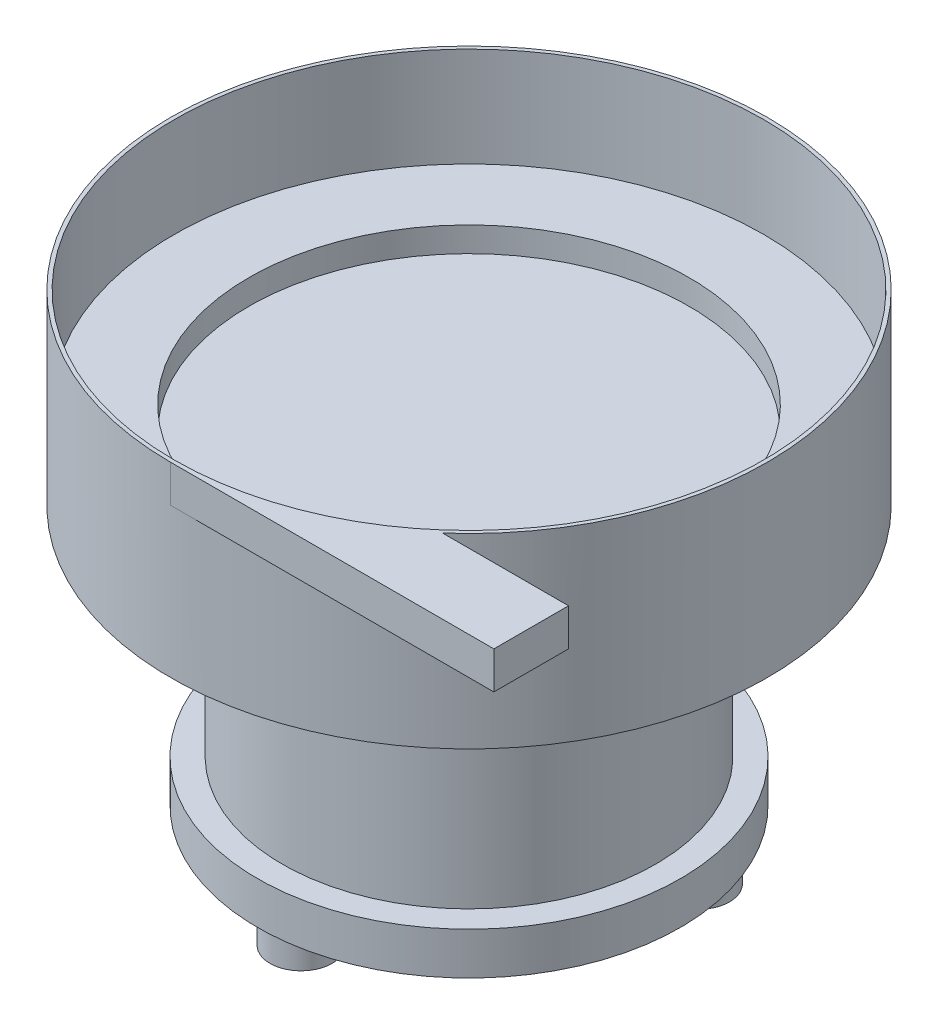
ISO-10303-21;
HEADER;
FILE_DESCRIPTION(('STEP AP214'),'2;1');
FILE_NAME('part.step','',(''),(''),'','','');
FILE_SCHEMA(('AUTOMOTIVE_DESIGN { 1 0 10303 214 1 1 1 1 }'));
ENDSEC;
DATA;
#1=APPLICATION_CONTEXT('core data for automotive mechanical design processes');
#2=APPLICATION_PROTOCOL_DEFINITION('international standard','automotive_design',2000,#1);
#3=PRODUCT_CONTEXT('',#1,'mechanical');
#4=PRODUCT('Part','Part','',(#3));
#5=PRODUCT_RELATED_PRODUCT_CATEGORY('part','',(#4));
#6=PRODUCT_DEFINITION_FORMATION('','',#4);
#7=PRODUCT_DEFINITION_CONTEXT('part definition',#1,'design');
#8=PRODUCT_DEFINITION('design','',#6,#7);
#9=PRODUCT_DEFINITION_SHAPE('','',#8);
#10=(LENGTH_UNIT() NAMED_UNIT(*) SI_UNIT(.MILLI.,.METRE.));
#11=(NAMED_UNIT(*) PLANE_ANGLE_UNIT() SI_UNIT($,.RADIAN.));
#12=(NAMED_UNIT(*) SI_UNIT($,.STERADIAN.) SOLID_ANGLE_UNIT());
#13=UNCERTAINTY_MEASURE_WITH_UNIT(LENGTH_MEASURE(1.E-05),#10,'distance_accuracy_value','');
#14=(GEOMETRIC_REPRESENTATION_CONTEXT(3) GLOBAL_UNCERTAINTY_ASSIGNED_CONTEXT((#13)) GLOBAL_UNIT_ASSIGNED_CONTEXT((#10,
#11,#12)) REPRESENTATION_CONTEXT('',''));
#15=CARTESIAN_POINT('',(0.,0.,0.));
#16=DIRECTION('',(0.,0.,1.));
#17=DIRECTION('',(1.,0.,0.));
#18=AXIS2_PLACEMENT_3D('',#15,#16,#17);
#19=CARTESIAN_POINT('',(0.,0.,0.));
#20=DIRECTION('',(0.,-1.,0.));
#21=DIRECTION('',(0.,0.,-1.));
#22=AXIS2_PLACEMENT_3D('',#19,#20,#21);
#23=CYLINDRICAL_SURFACE('',#22,240.);
#24=CARTESIAN_POINT('',(0.,209.,0.));
#25=DIRECTION('',(0.,-1.,0.));
#26=DIRECTION('',(0.,0.,-1.));
#27=AXIS2_PLACEMENT_3D('',#24,#25,#26);
#28=CIRCLE('',#27,240.);
#29=CARTESIAN_POINT('',(0.,209.,-240.));
#30=VERTEX_POINT('',#29);
#31=EDGE_CURVE('E116',#30,#30,#28,.T.);
#32=ORIENTED_EDGE('',*,*,#31,.F.);
#33=EDGE_LOOP('',(#32));
#34=FACE_BOUND('',#33,.T.);
#35=CARTESIAN_POINT('',(0.,359.,0.));
#36=DIRECTION('',(0.,-1.,0.));
#37=DIRECTION('',(0.,0.,-1.));
#38=AXIS2_PLACEMENT_3D('',#35,#36,#37);
#39=CIRCLE('',#38,240.);
#40=CARTESIAN_POINT('',(0.,359.,240.));
#41=VERTEX_POINT('',#40);
#42=CARTESIAN_POINT('',(158.745078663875,359.,180.));
#43=VERTEX_POINT('',#42);
#44=EDGE_CURVE('E111',#41,#43,#39,.T.);
#45=ORIENTED_EDGE('',*,*,#44,.T.);
#46=DIRECTION('',(0.,-1.,0.));
#47=VECTOR('',#46,1.);
#48=CARTESIAN_POINT('',(158.745078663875,0.,180.));
#49=LINE('',#48,#47);
#50=CARTESIAN_POINT('',(158.745078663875,329.,180.));
#51=VERTEX_POINT('',#50);
#52=EDGE_CURVE('E74',#43,#51,#49,.T.);
#53=ORIENTED_EDGE('',*,*,#52,.T.);
#54=CARTESIAN_POINT('',(0.,329.,0.));
#55=DIRECTION('',(0.,1.,0.));
#56=DIRECTION('',(0.,0.,1.));
#57=AXIS2_PLACEMENT_3D('',#54,#55,#56);
#58=CIRCLE('',#57,240.);
#59=CARTESIAN_POINT('',(0.,329.,240.));
#60=VERTEX_POINT('',#59);
#61=EDGE_CURVE('E39',#51,#60,#58,.F.);
#62=ORIENTED_EDGE('',*,*,#61,.T.);
#63=DIRECTION('',(0.,-1.,0.));
#64=VECTOR('',#63,1.);
#65=CARTESIAN_POINT('',(0.,359.,240.));
#66=LINE('',#65,#64);
#67=EDGE_CURVE('E71',#41,#60,#66,.T.);
#68=ORIENTED_EDGE('',*,*,#67,.F.);
#69=EDGE_LOOP('',(#45,#53,#62,#68));
#70=FACE_BOUND('',#69,.T.);
#71=ADVANCED_FACE('F16',(#34,#70),#23,.T.);
#72=CARTESIAN_POINT('',(0.,279.,0.));
#73=DIRECTION('',(0.,1.,0.));
#74=DIRECTION('',(0.,0.,1.));
#75=AXIS2_PLACEMENT_3D('',#72,#73,#74);
#76=CYLINDRICAL_SURFACE('',#75,237.);
#77=CARTESIAN_POINT('',(0.,359.,0.));
#78=DIRECTION('',(0.,1.,0.));
#79=DIRECTION('',(0.,0.,1.));
#80=AXIS2_PLACEMENT_3D('',#77,#78,#79);
#81=CIRCLE('',#80,237.);
#82=CARTESIAN_POINT('',(0.,359.,237.));
#83=VERTEX_POINT('',#82);
#84=EDGE_CURVE('E87',#83,#83,#81,.T.);
#85=ORIENTED_EDGE('',*,*,#84,.T.);
#86=EDGE_LOOP('',(#85));
#87=FACE_BOUND('',#86,.T.);
#88=CARTESIAN_POINT('',(0.,279.,0.));
#89=DIRECTION('',(0.,1.,0.));
#90=DIRECTION('',(0.,0.,1.));
#91=AXIS2_PLACEMENT_3D('',#88,#89,#90);
#92=CIRCLE('',#91,237.);
#93=CARTESIAN_POINT('',(0.,279.,237.));
#94=VERTEX_POINT('',#93);
#95=EDGE_CURVE('E90',#94,#94,#92,.T.);
#96=ORIENTED_EDGE('',*,*,#95,.F.);
#97=EDGE_LOOP('',(#96));
#98=FACE_BOUND('',#97,.T.);
#99=ADVANCED_FACE('F145',(#87,#98),#76,.F.);
#100=CARTESIAN_POINT('',(0.,0.,0.));
#101=DIRECTION('',(0.,-1.,0.));
#102=DIRECTION('',(0.,0.,-1.));
#103=AXIS2_PLACEMENT_3D('',#100,#101,#102);
#104=PLANE('',#103);
#105=CARTESIAN_POINT('',(-116.913429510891,0.,-67.500000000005));
#106=DIRECTION('',(0.,-1.,0.));
#107=DIRECTION('',(0.,0.,-1.));
#108=AXIS2_PLACEMENT_3D('',#105,#106,#107);
#109=CIRCLE('',#108,25.);
#110=CARTESIAN_POINT('',(-116.913429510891,0.,-92.500000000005));
#111=VERTEX_POINT('',#110);
#112=EDGE_CURVE('E93',#111,#111,#109,.T.);
#113=ORIENTED_EDGE('',*,*,#112,.F.);
#114=EDGE_LOOP('',(#113));
#115=FACE_BOUND('',#114,.T.);
#116=CARTESIAN_POINT('',(116.913429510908,0.,-67.499999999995));
#117=DIRECTION('',(0.,-1.,0.));
#118=DIRECTION('',(0.,0.,-1.));
#119=AXIS2_PLACEMENT_3D('',#116,#117,#118);
#120=CIRCLE('',#119,25.);
#121=CARTESIAN_POINT('',(116.913429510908,0.,-92.499999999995));
#122=VERTEX_POINT('',#121);
#123=EDGE_CURVE('E99',#122,#122,#120,.T.);
#124=ORIENTED_EDGE('',*,*,#123,.F.);
#125=EDGE_LOOP('',(#124));
#126=FACE_BOUND('',#125,.T.);
#127=CARTESIAN_POINT('',(0.,0.,135.));
#128=DIRECTION('',(0.,-1.,0.));
#129=DIRECTION('',(0.,0.,-1.));
#130=AXIS2_PLACEMENT_3D('',#127,#128,#129);
#131=CIRCLE('',#130,25.);
#132=CARTESIAN_POINT('',(0.,0.,110.));
#133=VERTEX_POINT('',#132);
#134=EDGE_CURVE('E105',#133,#133,#131,.T.);
#135=ORIENTED_EDGE('',*,*,#134,.F.);
#136=EDGE_LOOP('',(#135));
#137=FACE_BOUND('',#136,.T.);
#138=CARTESIAN_POINT('',(0.,0.,0.));
#139=DIRECTION('',(0.,-1.,0.));
#140=DIRECTION('',(0.,0.,-1.));
#141=AXIS2_PLACEMENT_3D('',#138,#139,#140);
#142=CIRCLE('',#141,170.);
#143=CARTESIAN_POINT('',(0.,0.,-170.));
#144=VERTEX_POINT('',#143);
#145=EDGE_CURVE('E11',#144,#144,#142,.T.);
#146=ORIENTED_EDGE('',*,*,#145,.T.);
#147=EDGE_LOOP('',(#146));
#148=FACE_BOUND('',#147,.T.);
#149=ADVANCED_FACE('F18',(#115,#126,#137,#148),#104,.T.);
#150=CARTESIAN_POINT('',(0.,0.,0.));
#151=DIRECTION('',(0.,-1.,0.));
#152=DIRECTION('',(0.,0.,-1.));
#153=AXIS2_PLACEMENT_3D('',#150,#151,#152);
#154=CYLINDRICAL_SURFACE('',#153,170.);
#155=CARTESIAN_POINT('',(0.,34.,0.));
#156=DIRECTION('',(0.,-1.,0.));
#157=DIRECTION('',(0.,0.,-1.));
#158=AXIS2_PLACEMENT_3D('',#155,#156,#157);
#159=CIRCLE('',#158,170.);
#160=CARTESIAN_POINT('',(0.,34.,-170.));
#161=VERTEX_POINT('',#160);
#162=EDGE_CURVE('E24',#161,#161,#159,.T.);
#163=ORIENTED_EDGE('',*,*,#162,.T.);
#164=EDGE_LOOP('',(#163));
#165=FACE_BOUND('',#164,.T.);
#166=ORIENTED_EDGE('',*,*,#145,.F.);
#167=EDGE_LOOP('',(#166));
#168=FACE_BOUND('',#167,.T.);
#169=ADVANCED_FACE('F127',(#165,#168),#154,.T.);
#170=CARTESIAN_POINT('',(170.,34.,0.));
#171=DIRECTION('',(0.,1.,0.));
#172=DIRECTION('',(0.,0.,1.));
#173=AXIS2_PLACEMENT_3D('',#170,#171,#172);
#174=PLANE('',#173);
#175=CARTESIAN_POINT('',(0.,34.,0.));
#176=DIRECTION('',(0.,-1.,0.));
#177=DIRECTION('',(0.,0.,-1.));
#178=AXIS2_PLACEMENT_3D('',#175,#176,#177);
#179=CIRCLE('',#178,150.);
#180=CARTESIAN_POINT('',(0.,34.,-150.));
#181=VERTEX_POINT('',#180);
#182=EDGE_CURVE('E122',#181,#181,#179,.T.);
#183=ORIENTED_EDGE('',*,*,#182,.T.);
#184=EDGE_LOOP('',(#183));
#185=FACE_BOUND('',#184,.T.);
#186=ORIENTED_EDGE('',*,*,#162,.F.);
#187=EDGE_LOOP('',(#186));
#188=FACE_BOUND('',#187,.T.);
#189=ADVANCED_FACE('F130',(#185,#188),#174,.T.);
#190=CARTESIAN_POINT('',(0.,0.,0.));
#191=DIRECTION('',(0.,-1.,0.));
#192=DIRECTION('',(0.,0.,-1.));
#193=AXIS2_PLACEMENT_3D('',#190,#191,#192);
#194=CYLINDRICAL_SURFACE('',#193,150.);
#195=CARTESIAN_POINT('',(0.,209.,0.));
#196=DIRECTION('',(0.,-1.,0.));
#197=DIRECTION('',(0.,0.,-1.));
#198=AXIS2_PLACEMENT_3D('',#195,#196,#197);
#199=CIRCLE('',#198,150.);
#200=CARTESIAN_POINT('',(0.,209.,-150.));
#201=VERTEX_POINT('',#200);
#202=EDGE_CURVE('E119',#201,#201,#199,.T.);
#203=ORIENTED_EDGE('',*,*,#202,.T.);
#204=EDGE_LOOP('',(#203));
#205=FACE_BOUND('',#204,.T.);
#206=ORIENTED_EDGE('',*,*,#182,.F.);
#207=EDGE_LOOP('',(#206));
#208=FACE_BOUND('',#207,.T.);
#209=ADVANCED_FACE('F132',(#205,#208),#194,.T.);
#210=CARTESIAN_POINT('',(150.,209.,0.));
#211=DIRECTION('',(0.,-1.,0.));
#212=DIRECTION('',(0.,0.,-1.));
#213=AXIS2_PLACEMENT_3D('',#210,#211,#212);
#214=PLANE('',#213);
#215=ORIENTED_EDGE('',*,*,#31,.T.);
#216=EDGE_LOOP('',(#215));
#217=FACE_BOUND('',#216,.T.);
#218=ORIENTED_EDGE('',*,*,#202,.F.);
#219=EDGE_LOOP('',(#218));
#220=FACE_BOUND('',#219,.T.);
#221=ADVANCED_FACE('F141',(#217,#220),#214,.T.);
#222=CARTESIAN_POINT('',(240.,359.,0.));
#223=DIRECTION('',(0.,1.,0.));
#224=DIRECTION('',(0.,0.,1.));
#225=AXIS2_PLACEMENT_3D('',#222,#223,#224);
#226=PLANE('',#225);
#227=ORIENTED_EDGE('',*,*,#84,.F.);
#228=EDGE_LOOP('',(#227));
#229=FACE_BOUND('',#228,.T.);
#230=ORIENTED_EDGE('',*,*,#44,.F.);
#231=DIRECTION('',(-1.,0.,0.));
#232=VECTOR('',#231,1.);
#233=CARTESIAN_POINT('',(260.,359.,240.));
#234=LINE('',#233,#232);
#235=CARTESIAN_POINT('',(260.,359.,240.));
#236=VERTEX_POINT('',#235);
#237=EDGE_CURVE('E31',#236,#41,#234,.T.);
#238=ORIENTED_EDGE('',*,*,#237,.F.);
#239=DIRECTION('',(0.,0.,1.));
#240=VECTOR('',#239,1.);
#241=CARTESIAN_POINT('',(260.,359.,240.));
#242=LINE('',#241,#240);
#243=CARTESIAN_POINT('',(260.,359.,180.));
#244=VERTEX_POINT('',#243);
#245=EDGE_CURVE('E70',#244,#236,#242,.T.);
#246=ORIENTED_EDGE('',*,*,#245,.F.);
#247=DIRECTION('',(-1.,0.,0.));
#248=VECTOR('',#247,1.);
#249=CARTESIAN_POINT('',(260.,359.,180.));
#250=LINE('',#249,#248);
#251=EDGE_CURVE('E78',#244,#43,#250,.T.);
#252=ORIENTED_EDGE('',*,*,#251,.T.);
#253=EDGE_LOOP('',(#230,#238,#246,#252));
#254=FACE_BOUND('',#253,.T.);
#255=ADVANCED_FACE('F158',(#229,#254),#226,.T.);
#256=CARTESIAN_POINT('',(0.,-30.,135.));
#257=DIRECTION('',(0.,1.,0.));
#258=DIRECTION('',(0.,0.,1.));
#259=AXIS2_PLACEMENT_3D('',#256,#257,#258);
#260=CYLINDRICAL_SURFACE('',#259,25.);
#261=CARTESIAN_POINT('',(0.,-30.,135.));
#262=DIRECTION('',(0.,-1.,0.));
#263=DIRECTION('',(0.,0.,-1.));
#264=AXIS2_PLACEMENT_3D('',#261,#262,#263);
#265=CIRCLE('',#264,25.);
#266=CARTESIAN_POINT('',(0.,-30.,110.));
#267=VERTEX_POINT('',#266);
#268=EDGE_CURVE('E108',#267,#267,#265,.T.);
#269=ORIENTED_EDGE('',*,*,#268,.F.);
#270=EDGE_LOOP('',(#269));
#271=FACE_BOUND('',#270,.T.);
#272=ORIENTED_EDGE('',*,*,#134,.T.);
#273=EDGE_LOOP('',(#272));
#274=FACE_BOUND('',#273,.T.);
#275=ADVANCED_FACE('F166',(#271,#274),#260,.T.);
#276=CARTESIAN_POINT('',(0.,-30.,135.));
#277=DIRECTION('',(0.,-1.,0.));
#278=DIRECTION('',(0.,0.,-1.));
#279=AXIS2_PLACEMENT_3D('',#276,#277,#278);
#280=PLANE('',#279);
#281=ORIENTED_EDGE('',*,*,#268,.T.);
#282=EDGE_LOOP('',(#281));
#283=FACE_BOUND('',#282,.T.);
#284=ADVANCED_FACE('F176',(#283),#280,.T.);
#285=CARTESIAN_POINT('',(116.913429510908,-30.,-67.499999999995));
#286=DIRECTION('',(0.,1.,0.));
#287=DIRECTION('',(0.,0.,1.));
#288=AXIS2_PLACEMENT_3D('',#285,#286,#287);
#289=CYLINDRICAL_SURFACE('',#288,25.);
#290=CARTESIAN_POINT('',(116.913429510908,-30.,-67.499999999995));
#291=DIRECTION('',(0.,-1.,0.));
#292=DIRECTION('',(0.,0.,-1.));
#293=AXIS2_PLACEMENT_3D('',#290,#291,#292);
#294=CIRCLE('',#293,25.);
#295=CARTESIAN_POINT('',(116.913429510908,-30.,-92.499999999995));
#296=VERTEX_POINT('',#295);
#297=EDGE_CURVE('E102',#296,#296,#294,.T.);
#298=ORIENTED_EDGE('',*,*,#297,.F.);
#299=EDGE_LOOP('',(#298));
#300=FACE_BOUND('',#299,.T.);
#301=ORIENTED_EDGE('',*,*,#123,.T.);
#302=EDGE_LOOP('',(#301));
#303=FACE_BOUND('',#302,.T.);
#304=ADVANCED_FACE('F224',(#300,#303),#289,.T.);
#305=CARTESIAN_POINT('',(116.913429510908,-30.,-67.499999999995));
#306=DIRECTION('',(0.,-1.,0.));
#307=DIRECTION('',(0.,0.,-1.));
#308=AXIS2_PLACEMENT_3D('',#305,#306,#307);
#309=PLANE('',#308);
#310=ORIENTED_EDGE('',*,*,#297,.T.);
#311=EDGE_LOOP('',(#310));
#312=FACE_BOUND('',#311,.T.);
#313=ADVANCED_FACE('F220',(#312),#309,.T.);
#314=CARTESIAN_POINT('',(-116.913429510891,-30.,-67.500000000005));
#315=DIRECTION('',(0.,1.,0.));
#316=DIRECTION('',(0.,0.,1.));
#317=AXIS2_PLACEMENT_3D('',#314,#315,#316);
#318=CYLINDRICAL_SURFACE('',#317,25.);
#319=CARTESIAN_POINT('',(-116.913429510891,-30.,-67.500000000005));
#320=DIRECTION('',(0.,-1.,0.));
#321=DIRECTION('',(0.,0.,-1.));
#322=AXIS2_PLACEMENT_3D('',#319,#320,#321);
#323=CIRCLE('',#322,25.);
#324=CARTESIAN_POINT('',(-116.913429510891,-30.,-92.500000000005));
#325=VERTEX_POINT('',#324);
#326=EDGE_CURVE('E96',#325,#325,#323,.T.);
#327=ORIENTED_EDGE('',*,*,#326,.F.);
#328=EDGE_LOOP('',(#327));
#329=FACE_BOUND('',#328,.T.);
#330=ORIENTED_EDGE('',*,*,#112,.T.);
#331=EDGE_LOOP('',(#330));
#332=FACE_BOUND('',#331,.T.);
#333=ADVANCED_FACE('F216',(#329,#332),#318,.T.);
#334=CARTESIAN_POINT('',(-116.913429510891,-30.,-67.500000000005));
#335=DIRECTION('',(0.,-1.,0.));
#336=DIRECTION('',(0.,0.,-1.));
#337=AXIS2_PLACEMENT_3D('',#334,#335,#336);
#338=PLANE('',#337);
#339=ORIENTED_EDGE('',*,*,#326,.T.);
#340=EDGE_LOOP('',(#339));
#341=FACE_BOUND('',#340,.T.);
#342=ADVANCED_FACE('F211',(#341),#338,.T.);
#343=CARTESIAN_POINT('',(0.,279.,0.));
#344=DIRECTION('',(0.,1.,0.));
#345=DIRECTION('',(0.,0.,1.));
#346=AXIS2_PLACEMENT_3D('',#343,#344,#345);
#347=PLANE('',#346);
#348=CARTESIAN_POINT('',(0.,279.,0.));
#349=DIRECTION('',(0.,1.,0.));
#350=DIRECTION('',(0.,0.,1.));
#351=AXIS2_PLACEMENT_3D('',#348,#349,#350);
#352=CIRCLE('',#351,177.);
#353=CARTESIAN_POINT('',(0.,279.,177.));
#354=VERTEX_POINT('',#353);
#355=EDGE_CURVE('E83',#354,#354,#352,.T.);
#356=ORIENTED_EDGE('',*,*,#355,.F.);
#357=EDGE_LOOP('',(#356));
#358=FACE_BOUND('',#357,.T.);
#359=ORIENTED_EDGE('',*,*,#95,.T.);
#360=EDGE_LOOP('',(#359));
#361=FACE_BOUND('',#360,.T.);
#362=ADVANCED_FACE('F208',(#358,#361),#347,.T.);
#363=CARTESIAN_POINT('',(0.,259.,0.));
#364=DIRECTION('',(0.,1.,0.));
#365=DIRECTION('',(0.,0.,1.));
#366=AXIS2_PLACEMENT_3D('',#363,#364,#365);
#367=CYLINDRICAL_SURFACE('',#366,177.);
#368=CARTESIAN_POINT('',(0.,259.,0.));
#369=DIRECTION('',(0.,1.,0.));
#370=DIRECTION('',(0.,0.,1.));
#371=AXIS2_PLACEMENT_3D('',#368,#369,#370);
#372=CIRCLE('',#371,177.);
#373=CARTESIAN_POINT('',(0.,259.,177.));
#374=VERTEX_POINT('',#373);
#375=EDGE_CURVE('E84',#374,#374,#372,.T.);
#376=ORIENTED_EDGE('',*,*,#375,.F.);
#377=EDGE_LOOP('',(#376));
#378=FACE_BOUND('',#377,.T.);
#379=ORIENTED_EDGE('',*,*,#355,.T.);
#380=EDGE_LOOP('',(#379));
#381=FACE_BOUND('',#380,.T.);
#382=ADVANCED_FACE('F204',(#378,#381),#367,.F.);
#383=CARTESIAN_POINT('',(0.,259.,0.));
#384=DIRECTION('',(0.,1.,0.));
#385=DIRECTION('',(0.,0.,1.));
#386=AXIS2_PLACEMENT_3D('',#383,#384,#385);
#387=PLANE('',#386);
#388=ORIENTED_EDGE('',*,*,#375,.T.);
#389=EDGE_LOOP('',(#388));
#390=FACE_BOUND('',#389,.T.);
#391=ADVANCED_FACE('F201',(#390),#387,.T.);
#392=CARTESIAN_POINT('',(260.,359.,240.));
#393=DIRECTION('',(0.,0.,-1.));
#394=DIRECTION('',(-1.,0.,0.));
#395=AXIS2_PLACEMENT_3D('',#392,#393,#394);
#396=PLANE('',#395);
#397=ORIENTED_EDGE('',*,*,#67,.T.);
#398=DIRECTION('',(-1.,0.,0.));
#399=VECTOR('',#398,1.);
#400=CARTESIAN_POINT('',(260.,329.,240.));
#401=LINE('',#400,#399);
#402=CARTESIAN_POINT('',(260.,329.,240.));
#403=VERTEX_POINT('',#402);
#404=EDGE_CURVE('E61',#403,#60,#401,.T.);
#405=ORIENTED_EDGE('',*,*,#404,.F.);
#406=DIRECTION('',(0.,-1.,0.));
#407=VECTOR('',#406,1.);
#408=CARTESIAN_POINT('',(260.,359.,240.));
#409=LINE('',#408,#407);
#410=EDGE_CURVE('E66',#236,#403,#409,.T.);
#411=ORIENTED_EDGE('',*,*,#410,.F.);
#412=ORIENTED_EDGE('',*,*,#237,.T.);
#413=EDGE_LOOP('',(#397,#405,#411,#412));
#414=FACE_BOUND('',#413,.T.);
#415=ADVANCED_FACE('F73',(#414),#396,.F.);
#416=CARTESIAN_POINT('',(260.,329.,240.));
#417=DIRECTION('',(0.,1.,0.));
#418=DIRECTION('',(0.,0.,1.));
#419=AXIS2_PLACEMENT_3D('',#416,#417,#418);
#420=PLANE('',#419);
#421=ORIENTED_EDGE('',*,*,#61,.F.);
#422=DIRECTION('',(-1.,0.,0.));
#423=VECTOR('',#422,1.);
#424=CARTESIAN_POINT('',(260.,329.,180.));
#425=LINE('',#424,#423);
#426=CARTESIAN_POINT('',(260.,329.,180.));
#427=VERTEX_POINT('',#426);
#428=EDGE_CURVE('E62',#427,#51,#425,.T.);
#429=ORIENTED_EDGE('',*,*,#428,.F.);
#430=DIRECTION('',(0.,0.,-1.));
#431=VECTOR('',#430,1.);
#432=CARTESIAN_POINT('',(260.,329.,240.));
#433=LINE('',#432,#431);
#434=EDGE_CURVE('E57',#403,#427,#433,.T.);
#435=ORIENTED_EDGE('',*,*,#434,.F.);
#436=ORIENTED_EDGE('',*,*,#404,.T.);
#437=EDGE_LOOP('',(#421,#429,#435,#436));
#438=FACE_BOUND('',#437,.T.);
#439=ADVANCED_FACE('F59',(#438),#420,.F.);
#440=CARTESIAN_POINT('',(260.,359.,180.));
#441=DIRECTION('',(0.,0.,1.));
#442=DIRECTION('',(1.,0.,0.));
#443=AXIS2_PLACEMENT_3D('',#440,#441,#442);
#444=PLANE('',#443);
#445=ORIENTED_EDGE('',*,*,#52,.F.);
#446=ORIENTED_EDGE('',*,*,#251,.F.);
#447=DIRECTION('',(0.,1.,0.));
#448=VECTOR('',#447,1.);
#449=CARTESIAN_POINT('',(260.,359.,180.));
#450=LINE('',#449,#448);
#451=EDGE_CURVE('E65',#427,#244,#450,.T.);
#452=ORIENTED_EDGE('',*,*,#451,.F.);
#453=ORIENTED_EDGE('',*,*,#428,.T.);
#454=EDGE_LOOP('',(#445,#446,#452,#453));
#455=FACE_BOUND('',#454,.T.);
#456=ADVANCED_FACE('F188',(#455),#444,.F.);
#457=CARTESIAN_POINT('',(260.,0.,0.));
#458=DIRECTION('',(1.,0.,0.));
#459=DIRECTION('',(0.,0.,-1.));
#460=AXIS2_PLACEMENT_3D('',#457,#458,#459);
#461=PLANE('',#460);
#462=ORIENTED_EDGE('',*,*,#410,.T.);
#463=ORIENTED_EDGE('',*,*,#434,.T.);
#464=ORIENTED_EDGE('',*,*,#451,.T.);
#465=ORIENTED_EDGE('',*,*,#245,.T.);
#466=EDGE_LOOP('',(#462,#463,#464,#465));
#467=FACE_BOUND('',#466,.T.);
#468=ADVANCED_FACE('F68',(#467),#461,.T.);
#469=CLOSED_SHELL('',(#71,#99,#149,#169,#189,#209,#221,#255,#275,#284,#304,#313,#333,#342,#362,
#382,#391,#415,#439,#456,#468));
#470=MANIFOLD_SOLID_BREP('B1',#469);
#471=ADVANCED_BREP_SHAPE_REPRESENTATION('',(#18,#470),#14);
#472=SHAPE_DEFINITION_REPRESENTATION(#9,#471);
ENDSEC;
END-ISO-10303-21;
